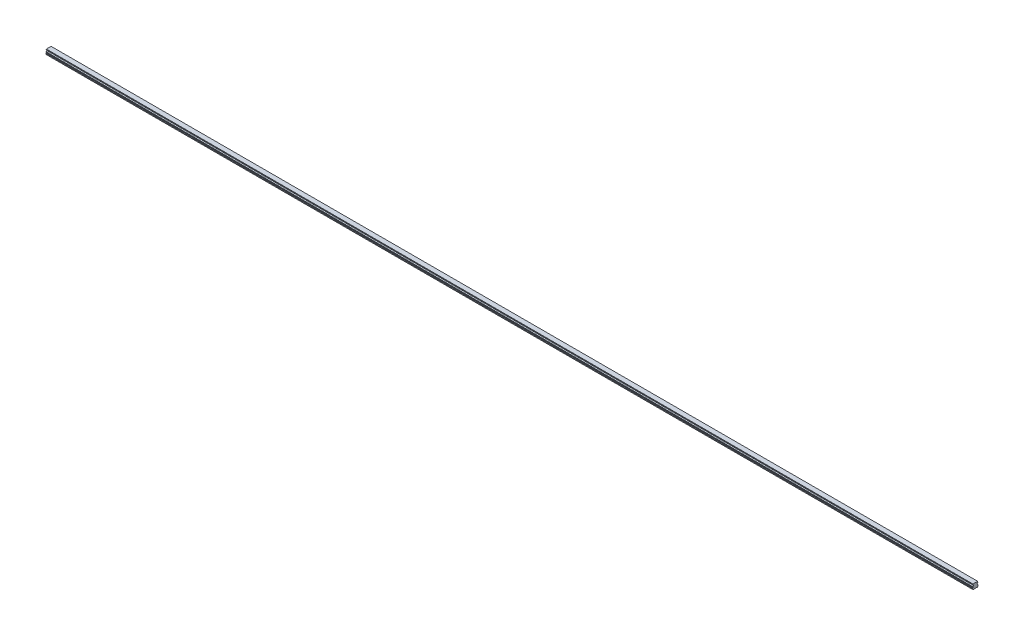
from build123d import *

# Parameters (mm, degrees)
BOSS_EXTRUDE1_DEPTH        = 2580
SKETCH3_R                  = 2.5
SKETCH3_R_2                = 2.1
CUT_EXTRUDE3_DEPTH         = 7
SKETCH3_2_R                = 2.1
CUT_EXTRUDE4_DEPTH         = 9.5
CHAMFER1_SIZE              = 0.4
LPATTERN2_COUNT            = 43
LPATTERN2_PITCH            = 60
CHAMFER1_OF_LPATTERN2_SIZE = 0.4


with BuildPart() as part:
    # Sketch1 → Boss-Extrude1 (new body)
    with BuildSketch(Plane(origin=(0, 0, 0), x_dir=(0, 0, -1), z_dir=(1, 0, 0))):
        with BuildLine():
            Line((6.59, 14), (-6.59, 14))
            Line((-6.59, 14), (-6.59, 13.15))
            Line((-6.59, 13.15), (-6.96, 12.356532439))
            Line((-6.96, 12.356532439), (-6.96, 11.435174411))
            ThreePointArc((-6.96, 11.435174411), (-5.25, 9.5), (-6.96, 7.564825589))
            Line((-6.96, 7.564825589), (-6.96, 6.643467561))
            Line((-6.96, 6.643467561), (-6.59, 5.85))
            Line((-6.59, 5.85), (-7.032116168, 4.2))
            Line((-7.032116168, 4.2), (-7.5, 3.929867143))
            Line((-7.5, 3.929867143), (-7.5, 1.4))
            Line((-7.5, 1.4), (-6.1, 0))
            Line((-6.1, 0), (-3.65, 0))
            Line((-3.65, 0), (-3.25, 0.4))
            Line((-3.25, 0.4), (3.25, 0.4))
            Line((3.25, 0.4), (3.65, 0))
            Line((3.65, 0), (6.1, 0))
            Line((6.1, 0), (7.5, 1.4))
            Line((7.5, 1.4), (7.5, 3.929867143))
            Line((7.5, 3.929867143), (7.032116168, 4.2))
            Line((7.032116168, 4.2), (6.59, 5.85))
            Line((6.59, 5.85), (6.96, 6.643467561))
            Line((6.96, 6.643467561), (6.96, 7.564825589))
            ThreePointArc((6.96, 7.564825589), (5.25, 9.5), (6.96, 11.435174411))
            Line((6.96, 11.435174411), (6.96, 12.356532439))
            Line((6.96, 12.356532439), (6.59, 13.15))
            Line((6.59, 13.15), (6.59, 14))
        make_face()
    extrude(amount=BOSS_EXTRUDE1_DEPTH)

    # Sketch3 → Cut-Extrude3 (cut)
    with BuildSketch(Plane.XZ):
        with Locations(Location((30, 0, 0), (0, 0, 270))):
            Circle(SKETCH3_R)
        with Locations(Location((30, 0, 0), (0, 0, 270))):
            Circle(SKETCH3_R_2, mode=Mode.SUBTRACT)
    cut_extrude3 = extrude(amount=-CUT_EXTRUDE3_DEPTH, mode=Mode.SUBTRACT)

    # Sketch3_2 → Cut-Extrude4 (cut)
    with BuildSketch(Plane.XZ):
        with Locations(Location((30, 0, 0), (0, 0, 270))):
            Circle(SKETCH3_2_R)
    cut_extrude4 = extrude(amount=-CUT_EXTRUDE4_DEPTH, mode=Mode.SUBTRACT)

    # Cut-Extrude5 cone 1 section (on through the dimple's axis) → Cut-Extrude5 (revolve, cut)
    with BuildSketch(Plane(origin=(30, 9.5, 0), x_dir=(0, 0, -1), z_dir=(1, 0, 0))):
        Polygon((0, 0), (2.1, 0), (0, 1.212435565), align=None)
    revolve(axis=Axis((30, 9.5, 0), (0, 1, 0)), mode=Mode.SUBTRACT)

    # Chamfer1
    chamfer1_edges = [part.edges().sort_by_distance(p)[0] for p in [
        (30, 0.4, 2.5),
    ]]
    chamfer(chamfer1_edges, length=CHAMFER1_SIZE)

    # LPattern2: Cut-Extrude3, Cut-Extrude4 ×43
    with Locations(*[(i * LPATTERN2_PITCH, 0, 0) for i in range(1, LPATTERN2_COUNT)]):
        add(cut_extrude3, mode=Mode.SUBTRACT)
        add(cut_extrude4, mode=Mode.SUBTRACT)

    # Chamfer1 of LPattern2
    chamfer1_of_lpattern2_edges = [part.edges().sort_by_distance(p)[0] for p in [
        (90, 0.4, 2.5),
        (150, 0.4, 2.5),
        (210, 0.4, 2.5),
        (270, 0.4, 2.5),
        (330, 0.4, 2.5),
        (390, 0.4, 2.5),
        (450, 0.4, 2.5),
        (510, 0.4, 2.5),
        (570, 0.4, 2.5),
        (630, 0.4, 2.5),
        (690, 0.4, 2.5),
        (750, 0.4, 2.5),
        (810, 0.4, 2.5),
        (870, 0.4, 2.5),
        (930, 0.4, 2.5),
        (990, 0.4, 2.5),
        (1050, 0.4, 2.5),
        (1110, 0.4, 2.5),
        (1170, 0.4, 2.5),
        (1230, 0.4, 2.5),
        (1290, 0.4, 2.5),
        (1350, 0.4, 2.5),
        (1410, 0.4, 2.5),
        (1470, 0.4, 2.5),
        (1530, 0.4, 2.5),
        (1590, 0.4, 2.5),
        (1650, 0.4, 2.5),
        (1710, 0.4, 2.5),
        (1770, 0.4, 2.5),
        (1830, 0.4, 2.5),
        (1890, 0.4, 2.5),
        (1950, 0.4, 2.5),
        (2010, 0.4, 2.5),
        (2070, 0.4, 2.5),
        (2130, 0.4, 2.5),
        (2190, 0.4, 2.5),
        (2250, 0.4, 2.5),
        (2310, 0.4, 2.5),
        (2370, 0.4, 2.5),
        (2430, 0.4, 2.5),
        (2490, 0.4, 2.5),
        (2550, 0.4, 2.5),
    ]]
    chamfer(chamfer1_of_lpattern2_edges, length=CHAMFER1_OF_LPATTERN2_SIZE)


solid = part.part
